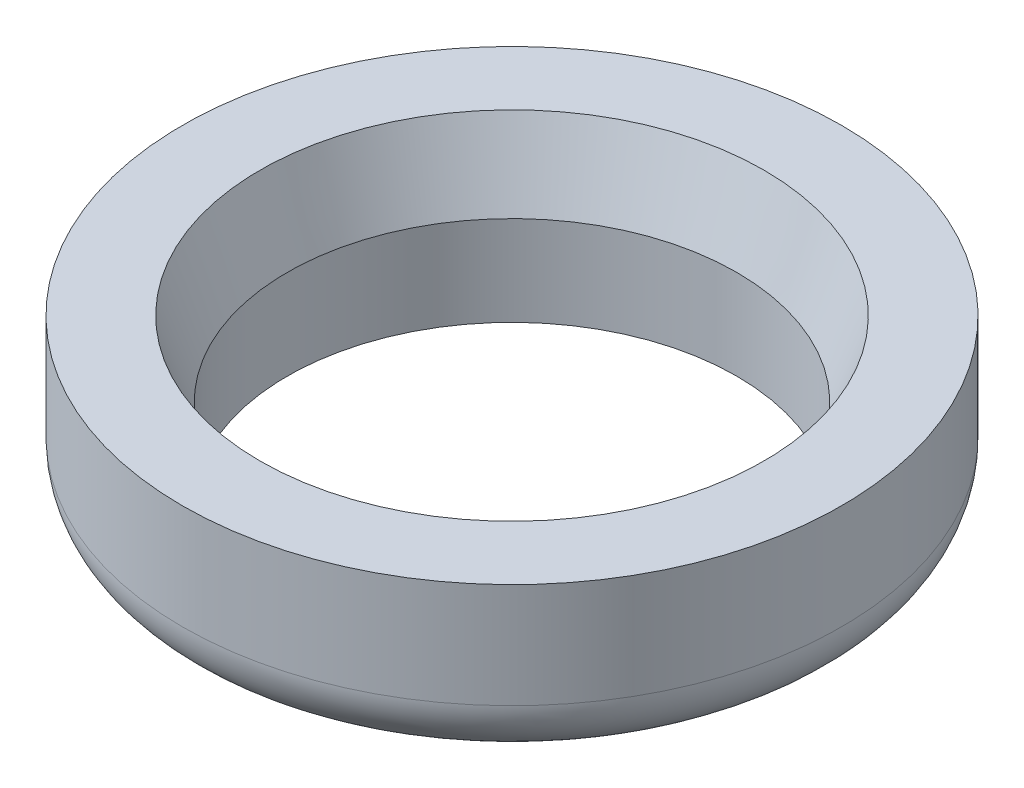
ISO-10303-21;
HEADER;
FILE_DESCRIPTION(('STEP AP214'),'2;1');
FILE_NAME('part.step','',(''),(''),'','','');
FILE_SCHEMA(('AUTOMOTIVE_DESIGN { 1 0 10303 214 1 1 1 1 }'));
ENDSEC;
DATA;
#1=APPLICATION_CONTEXT('core data for automotive mechanical design processes');
#2=APPLICATION_PROTOCOL_DEFINITION('international standard','automotive_design',2000,#1);
#3=PRODUCT_CONTEXT('',#1,'mechanical');
#4=PRODUCT('Part','Part','',(#3));
#5=PRODUCT_RELATED_PRODUCT_CATEGORY('part','',(#4));
#6=PRODUCT_DEFINITION_FORMATION('','',#4);
#7=PRODUCT_DEFINITION_CONTEXT('part definition',#1,'design');
#8=PRODUCT_DEFINITION('design','',#6,#7);
#9=PRODUCT_DEFINITION_SHAPE('','',#8);
#10=(LENGTH_UNIT() NAMED_UNIT(*) SI_UNIT(.MILLI.,.METRE.));
#11=(NAMED_UNIT(*) PLANE_ANGLE_UNIT() SI_UNIT($,.RADIAN.));
#12=(NAMED_UNIT(*) SI_UNIT($,.STERADIAN.) SOLID_ANGLE_UNIT());
#13=UNCERTAINTY_MEASURE_WITH_UNIT(LENGTH_MEASURE(1.E-05),#10,'distance_accuracy_value','');
#14=(GEOMETRIC_REPRESENTATION_CONTEXT(3) GLOBAL_UNCERTAINTY_ASSIGNED_CONTEXT((#13)) GLOBAL_UNIT_ASSIGNED_CONTEXT((#10,
#11,#12)) REPRESENTATION_CONTEXT('',''));
#15=CARTESIAN_POINT('',(0.,0.,0.));
#16=DIRECTION('',(0.,0.,1.));
#17=DIRECTION('',(1.,0.,0.));
#18=AXIS2_PLACEMENT_3D('',#15,#16,#17);
#19=CARTESIAN_POINT('',(0.,5.5,0.));
#20=DIRECTION('',(0.,-1.,0.));
#21=DIRECTION('',(0.,0.,-1.));
#22=AXIS2_PLACEMENT_3D('',#19,#20,#21);
#23=CYLINDRICAL_SURFACE('',#22,11.);
#24=CARTESIAN_POINT('',(0.,2.,0.));
#25=DIRECTION('',(0.,1.,0.));
#26=DIRECTION('',(0.,0.,1.));
#27=AXIS2_PLACEMENT_3D('',#24,#25,#26);
#28=CIRCLE('',#27,11.);
#29=CARTESIAN_POINT('',(0.,2.,11.));
#30=VERTEX_POINT('',#29);
#31=EDGE_CURVE('E40',#30,#30,#28,.T.);
#32=ORIENTED_EDGE('',*,*,#31,.T.);
#33=EDGE_LOOP('',(#32));
#34=FACE_BOUND('',#33,.T.);
#35=CARTESIAN_POINT('',(0.,5.5,0.));
#36=DIRECTION('',(0.,1.,0.));
#37=DIRECTION('',(0.,0.,1.));
#38=AXIS2_PLACEMENT_3D('',#35,#36,#37);
#39=CIRCLE('',#38,11.);
#40=CARTESIAN_POINT('',(0.,5.5,11.));
#41=VERTEX_POINT('',#40);
#42=EDGE_CURVE('E45',#41,#41,#39,.T.);
#43=ORIENTED_EDGE('',*,*,#42,.F.);
#44=EDGE_LOOP('',(#43));
#45=FACE_BOUND('',#44,.T.);
#46=ADVANCED_FACE('F26',(#34,#45),#23,.T.);
#47=CARTESIAN_POINT('',(0.,5.5,0.));
#48=DIRECTION('',(0.,1.,0.));
#49=DIRECTION('',(0.,0.,1.));
#50=AXIS2_PLACEMENT_3D('',#47,#48,#49);
#51=PLANE('',#50);
#52=CARTESIAN_POINT('',(0.,5.5,0.));
#53=DIRECTION('',(0.,1.,0.));
#54=DIRECTION('',(0.,0.,1.));
#55=AXIS2_PLACEMENT_3D('',#52,#53,#54);
#56=CIRCLE('',#55,8.40992558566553);
#57=CARTESIAN_POINT('',(0.,5.5,8.40992558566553));
#58=VERTEX_POINT('',#57);
#59=EDGE_CURVE('E10',#58,#58,#56,.F.);
#60=ORIENTED_EDGE('',*,*,#59,.T.);
#61=EDGE_LOOP('',(#60));
#62=FACE_BOUND('',#61,.T.);
#63=ORIENTED_EDGE('',*,*,#42,.T.);
#64=EDGE_LOOP('',(#63));
#65=FACE_BOUND('',#64,.T.);
#66=ADVANCED_FACE('F65',(#62,#65),#51,.T.);
#67=CARTESIAN_POINT('',(0.,0.,0.));
#68=DIRECTION('',(0.,1.,0.));
#69=DIRECTION('',(0.,0.,1.));
#70=AXIS2_PLACEMENT_3D('',#67,#68,#69);
#71=PLANE('',#70);
#72=CARTESIAN_POINT('',(0.,0.,0.));
#73=DIRECTION('',(0.,1.,0.));
#74=DIRECTION('',(0.,0.,1.));
#75=AXIS2_PLACEMENT_3D('',#72,#73,#74);
#76=CIRCLE('',#75,9.);
#77=CARTESIAN_POINT('',(0.,0.,9.));
#78=VERTEX_POINT('',#77);
#79=EDGE_CURVE('E36',#78,#78,#76,.F.);
#80=ORIENTED_EDGE('',*,*,#79,.T.);
#81=EDGE_LOOP('',(#80));
#82=FACE_BOUND('',#81,.T.);
#83=CARTESIAN_POINT('',(0.,0.,0.));
#84=DIRECTION('',(0.,1.,0.));
#85=DIRECTION('',(0.,0.,1.));
#86=AXIS2_PLACEMENT_3D('',#83,#84,#85);
#87=CIRCLE('',#86,7.5);
#88=CARTESIAN_POINT('',(0.,0.,7.5));
#89=VERTEX_POINT('',#88);
#90=EDGE_CURVE('E48',#89,#89,#87,.T.);
#91=ORIENTED_EDGE('',*,*,#90,.T.);
#92=EDGE_LOOP('',(#91));
#93=FACE_BOUND('',#92,.T.);
#94=ADVANCED_FACE('F52',(#82,#93),#71,.F.);
#95=CARTESIAN_POINT('',(0.,0.,0.));
#96=DIRECTION('',(0.,1.,0.));
#97=DIRECTION('',(0.,0.,1.));
#98=AXIS2_PLACEMENT_3D('',#95,#96,#97);
#99=CYLINDRICAL_SURFACE('',#98,7.5);
#100=CARTESIAN_POINT('',(0.,2.99999999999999,0.));
#101=DIRECTION('',(0.,1.,0.));
#102=DIRECTION('',(0.,0.,1.));
#103=AXIS2_PLACEMENT_3D('',#100,#101,#102);
#104=CIRCLE('',#103,7.5);
#105=CARTESIAN_POINT('',(0.,2.99999999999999,7.5));
#106=VERTEX_POINT('',#105);
#107=EDGE_CURVE('E32',#106,#106,#104,.T.);
#108=ORIENTED_EDGE('',*,*,#107,.T.);
#109=EDGE_LOOP('',(#108));
#110=FACE_BOUND('',#109,.T.);
#111=ORIENTED_EDGE('',*,*,#90,.F.);
#112=EDGE_LOOP('',(#111));
#113=FACE_BOUND('',#112,.T.);
#114=ADVANCED_FACE('F54',(#110,#113),#99,.F.);
#115=CARTESIAN_POINT('',(0.,2.,0.));
#116=DIRECTION('',(0.,1.,0.));
#117=DIRECTION('',(0.,0.,1.));
#118=AXIS2_PLACEMENT_3D('',#115,#116,#117);
#119=TOROIDAL_SURFACE('',#118,9.,2.);
#120=ORIENTED_EDGE('',*,*,#79,.F.);
#121=EDGE_LOOP('',(#120));
#122=FACE_BOUND('',#121,.T.);
#123=ORIENTED_EDGE('',*,*,#31,.F.);
#124=EDGE_LOOP('',(#123));
#125=FACE_BOUND('',#124,.T.);
#126=ADVANCED_FACE('F56',(#122,#125),#119,.T.);
#127=CARTESIAN_POINT('',(0.,2.99999999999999,0.));
#128=DIRECTION('',(0.,1.,0.));
#129=DIRECTION('',(0.,0.,1.));
#130=AXIS2_PLACEMENT_3D('',#127,#128,#129);
#131=CONICAL_SURFACE('',#130,7.5,0.349065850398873);
#132=ORIENTED_EDGE('',*,*,#59,.F.);
#133=EDGE_LOOP('',(#132));
#134=FACE_BOUND('',#133,.T.);
#135=ORIENTED_EDGE('',*,*,#107,.F.);
#136=EDGE_LOOP('',(#135));
#137=FACE_BOUND('',#136,.T.);
#138=ADVANCED_FACE('F62',(#134,#137),#131,.F.);
#139=CLOSED_SHELL('',(#46,#66,#94,#114,#126,#138));
#140=MANIFOLD_SOLID_BREP('B2',#139);
#141=ADVANCED_BREP_SHAPE_REPRESENTATION('',(#18,#140),#14);
#142=SHAPE_DEFINITION_REPRESENTATION(#9,#141);
ENDSEC;
END-ISO-10303-21;
